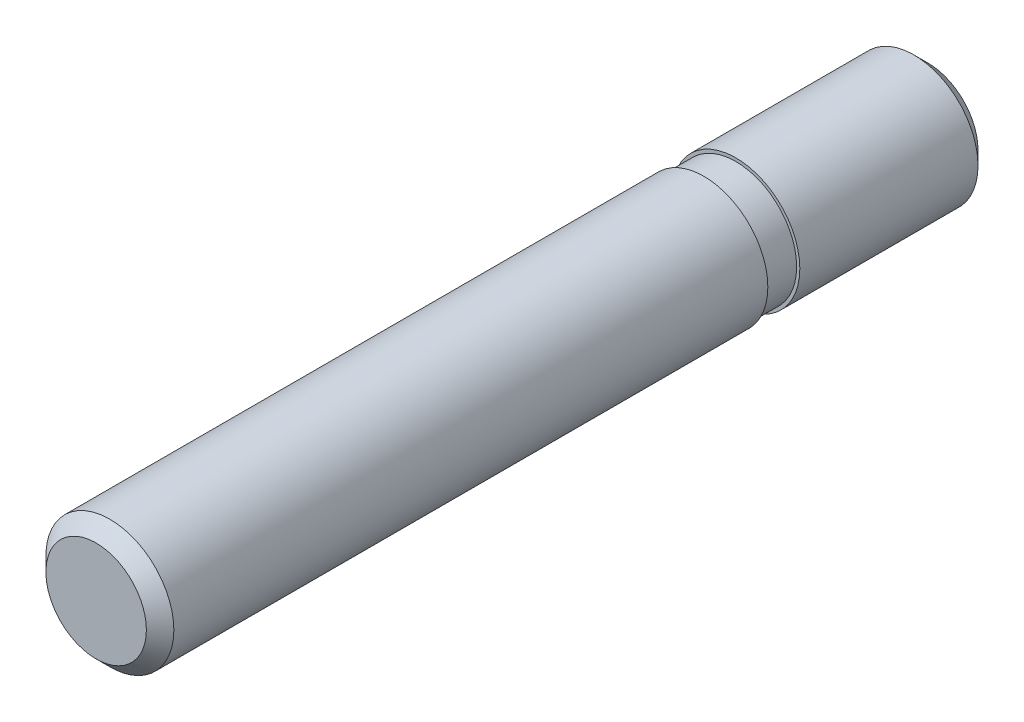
ISO-10303-21;
HEADER;
FILE_DESCRIPTION(('STEP AP214'),'2;1');
FILE_NAME('part.step','',(''),(''),'','','');
FILE_SCHEMA(('AUTOMOTIVE_DESIGN { 1 0 10303 214 1 1 1 1 }'));
ENDSEC;
DATA;
#1=APPLICATION_CONTEXT('core data for automotive mechanical design processes');
#2=APPLICATION_PROTOCOL_DEFINITION('international standard','automotive_design',2000,#1);
#3=PRODUCT_CONTEXT('',#1,'mechanical');
#4=PRODUCT('Part','Part','',(#3));
#5=PRODUCT_RELATED_PRODUCT_CATEGORY('part','',(#4));
#6=PRODUCT_DEFINITION_FORMATION('','',#4);
#7=PRODUCT_DEFINITION_CONTEXT('part definition',#1,'design');
#8=PRODUCT_DEFINITION('design','',#6,#7);
#9=PRODUCT_DEFINITION_SHAPE('','',#8);
#10=(LENGTH_UNIT() NAMED_UNIT(*) SI_UNIT(.MILLI.,.METRE.));
#11=(NAMED_UNIT(*) PLANE_ANGLE_UNIT() SI_UNIT($,.RADIAN.));
#12=(NAMED_UNIT(*) SI_UNIT($,.STERADIAN.) SOLID_ANGLE_UNIT());
#13=UNCERTAINTY_MEASURE_WITH_UNIT(LENGTH_MEASURE(1.E-05),#10,'distance_accuracy_value','');
#14=(GEOMETRIC_REPRESENTATION_CONTEXT(3) GLOBAL_UNCERTAINTY_ASSIGNED_CONTEXT((#13)) GLOBAL_UNIT_ASSIGNED_CONTEXT((#10,
#11,#12)) REPRESENTATION_CONTEXT('',''));
#15=CARTESIAN_POINT('',(0.,0.,0.));
#16=DIRECTION('',(0.,0.,1.));
#17=DIRECTION('',(1.,0.,0.));
#18=AXIS2_PLACEMENT_3D('',#15,#16,#17);
#19=CARTESIAN_POINT('',(0.,0.,1.));
#20=DIRECTION('',(0.,0.,1.));
#21=DIRECTION('',(1.,0.,0.));
#22=AXIS2_PLACEMENT_3D('',#19,#20,#21);
#23=PLANE('',#22);
#24=CARTESIAN_POINT('',(0.,0.,1.));
#25=DIRECTION('',(0.,0.,1.));
#26=DIRECTION('',(1.,0.,0.));
#27=AXIS2_PLACEMENT_3D('',#24,#25,#26);
#28=CIRCLE('',#27,2.);
#29=CARTESIAN_POINT('',(2.,0.,1.));
#30=VERTEX_POINT('',#29);
#31=EDGE_CURVE('E27',#30,#30,#28,.T.);
#32=ORIENTED_EDGE('',*,*,#31,.F.);
#33=EDGE_LOOP('',(#32));
#34=FACE_BOUND('',#33,.T.);
#35=CARTESIAN_POINT('',(0.,0.,1.));
#36=DIRECTION('',(0.,0.,1.));
#37=DIRECTION('',(1.,0.,0.));
#38=AXIS2_PLACEMENT_3D('',#35,#36,#37);
#39=CIRCLE('',#38,1.9);
#40=CARTESIAN_POINT('',(1.9,0.,1.));
#41=VERTEX_POINT('',#40);
#42=EDGE_CURVE('E8',#41,#41,#39,.F.);
#43=ORIENTED_EDGE('',*,*,#42,.F.);
#44=EDGE_LOOP('',(#43));
#45=FACE_BOUND('',#44,.T.);
#46=ADVANCED_FACE('F12',(#34,#45),#23,.F.);
#47=CARTESIAN_POINT('',(0.,0.,7.5));
#48=DIRECTION('',(0.,0.,1.));
#49=DIRECTION('',(1.,0.,0.));
#50=AXIS2_PLACEMENT_3D('',#47,#48,#49);
#51=CYLINDRICAL_SURFACE('',#50,2.);
#52=CARTESIAN_POINT('',(0.,0.,19.5705));
#53=DIRECTION('',(0.,0.,1.));
#54=DIRECTION('',(1.,0.,0.));
#55=AXIS2_PLACEMENT_3D('',#52,#53,#54);
#56=CIRCLE('',#55,2.);
#57=CARTESIAN_POINT('',(2.,0.,19.5705));
#58=VERTEX_POINT('',#57);
#59=EDGE_CURVE('E19',#58,#58,#56,.F.);
#60=ORIENTED_EDGE('',*,*,#59,.T.);
#61=EDGE_LOOP('',(#60));
#62=FACE_BOUND('',#61,.T.);
#63=ORIENTED_EDGE('',*,*,#31,.T.);
#64=EDGE_LOOP('',(#63));
#65=FACE_BOUND('',#64,.T.);
#66=ADVANCED_FACE('F14',(#62,#65),#51,.T.);
#67=CARTESIAN_POINT('',(0.,0.,20.));
#68=DIRECTION('',(0.,0.,1.));
#69=DIRECTION('',(1.,0.,0.));
#70=AXIS2_PLACEMENT_3D('',#67,#68,#69);
#71=PLANE('',#70);
#72=CARTESIAN_POINT('',(0.,0.,20.));
#73=DIRECTION('',(0.,0.,1.));
#74=DIRECTION('',(1.,0.,0.));
#75=AXIS2_PLACEMENT_3D('',#72,#73,#74);
#76=CIRCLE('',#75,1.5705);
#77=CARTESIAN_POINT('',(1.5705,0.,20.));
#78=VERTEX_POINT('',#77);
#79=EDGE_CURVE('E23',#78,#78,#76,.T.);
#80=ORIENTED_EDGE('',*,*,#79,.T.);
#81=EDGE_LOOP('',(#80));
#82=FACE_BOUND('',#81,.T.);
#83=ADVANCED_FACE('F64',(#82),#71,.T.);
#84=CARTESIAN_POINT('',(0.,0.,20.));
#85=DIRECTION('',(0.,0.,-1.));
#86=DIRECTION('',(-1.,0.,0.));
#87=AXIS2_PLACEMENT_3D('',#84,#85,#86);
#88=CONICAL_SURFACE('',#87,1.5705,0.785398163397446);
#89=ORIENTED_EDGE('',*,*,#59,.F.);
#90=EDGE_LOOP('',(#89));
#91=FACE_BOUND('',#90,.T.);
#92=ORIENTED_EDGE('',*,*,#79,.F.);
#93=EDGE_LOOP('',(#92));
#94=FACE_BOUND('',#93,.T.);
#95=ADVANCED_FACE('F71',(#91,#94),#88,.T.);
#96=CARTESIAN_POINT('',(0.,0.,4.66928550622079));
#97=DIRECTION('',(0.,0.,1.));
#98=DIRECTION('',(1.,0.,0.));
#99=AXIS2_PLACEMENT_3D('',#96,#97,#98);
#100=CYLINDRICAL_SURFACE('',#99,1.9);
#101=ORIENTED_EDGE('',*,*,#42,.T.);
#102=EDGE_LOOP('',(#101));
#103=FACE_BOUND('',#102,.T.);
#104=CARTESIAN_POINT('',(0.,0.,0.));
#105=DIRECTION('',(0.,0.,1.));
#106=DIRECTION('',(1.,0.,0.));
#107=AXIS2_PLACEMENT_3D('',#104,#105,#106);
#108=CIRCLE('',#107,1.9);
#109=CARTESIAN_POINT('',(1.9,0.,0.));
#110=VERTEX_POINT('',#109);
#111=EDGE_CURVE('E34',#110,#110,#108,.T.);
#112=ORIENTED_EDGE('',*,*,#111,.T.);
#113=EDGE_LOOP('',(#112));
#114=FACE_BOUND('',#113,.T.);
#115=ADVANCED_FACE('F45',(#103,#114),#100,.T.);
#116=CARTESIAN_POINT('',(0.,0.78525,-6.));
#117=DIRECTION('',(0.,0.,-1.));
#118=DIRECTION('',(-1.,0.,0.));
#119=AXIS2_PLACEMENT_3D('',#116,#117,#118);
#120=PLANE('',#119);
#121=CARTESIAN_POINT('',(0.,0.,-5.99999999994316));
#122=DIRECTION('',(0.,0.,1.));
#123=DIRECTION('',(1.,0.,0.));
#124=AXIS2_PLACEMENT_3D('',#121,#122,#123);
#125=CIRCLE('',#124,1.57050000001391);
#126=CARTESIAN_POINT('',(1.57050000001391,0.,-5.99999999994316));
#127=VERTEX_POINT('',#126);
#128=EDGE_CURVE('E30',#127,#127,#125,.T.);
#129=ORIENTED_EDGE('',*,*,#128,.F.);
#130=EDGE_LOOP('',(#129));
#131=FACE_BOUND('',#130,.T.);
#132=ADVANCED_FACE('F81',(#131),#120,.T.);
#133=CARTESIAN_POINT('',(0.,0.,-5.5705000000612));
#134=DIRECTION('',(0.,0.,1.));
#135=DIRECTION('',(1.,0.,0.));
#136=AXIS2_PLACEMENT_3D('',#133,#134,#135);
#137=CONICAL_SURFACE('',#136,1.9999999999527,0.785398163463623);
#138=CARTESIAN_POINT('',(0.,0.,-5.5705));
#139=DIRECTION('',(0.,0.,1.));
#140=DIRECTION('',(1.,0.,0.));
#141=AXIS2_PLACEMENT_3D('',#138,#139,#140);
#142=CIRCLE('',#141,2.);
#143=CARTESIAN_POINT('',(2.,0.,-5.5705));
#144=VERTEX_POINT('',#143);
#145=EDGE_CURVE('E33',#144,#144,#142,.T.);
#146=ORIENTED_EDGE('',*,*,#145,.F.);
#147=EDGE_LOOP('',(#146));
#148=FACE_BOUND('',#147,.T.);
#149=ORIENTED_EDGE('',*,*,#128,.T.);
#150=EDGE_LOOP('',(#149));
#151=FACE_BOUND('',#150,.T.);
#152=ADVANCED_FACE('F56',(#148,#151),#137,.T.);
#153=CARTESIAN_POINT('',(0.,0.,7.5));
#154=DIRECTION('',(0.,0.,1.));
#155=DIRECTION('',(1.,0.,0.));
#156=AXIS2_PLACEMENT_3D('',#153,#154,#155);
#157=CYLINDRICAL_SURFACE('',#156,2.);
#158=CARTESIAN_POINT('',(0.,0.,0.));
#159=DIRECTION('',(0.,0.,1.));
#160=DIRECTION('',(1.,0.,0.));
#161=AXIS2_PLACEMENT_3D('',#158,#159,#160);
#162=CIRCLE('',#161,2.);
#163=CARTESIAN_POINT('',(2.,0.,0.));
#164=VERTEX_POINT('',#163);
#165=EDGE_CURVE('E35',#164,#164,#162,.T.);
#166=ORIENTED_EDGE('',*,*,#165,.F.);
#167=EDGE_LOOP('',(#166));
#168=FACE_BOUND('',#167,.T.);
#169=ORIENTED_EDGE('',*,*,#145,.T.);
#170=EDGE_LOOP('',(#169));
#171=FACE_BOUND('',#170,.T.);
#172=ADVANCED_FACE('F49',(#168,#171),#157,.T.);
#173=CARTESIAN_POINT('',(0.,0.,0.));
#174=DIRECTION('',(0.,0.,1.));
#175=DIRECTION('',(1.,0.,0.));
#176=AXIS2_PLACEMENT_3D('',#173,#174,#175);
#177=PLANE('',#176);
#178=ORIENTED_EDGE('',*,*,#165,.T.);
#179=EDGE_LOOP('',(#178));
#180=FACE_BOUND('',#179,.T.);
#181=ORIENTED_EDGE('',*,*,#111,.F.);
#182=EDGE_LOOP('',(#181));
#183=FACE_BOUND('',#182,.T.);
#184=ADVANCED_FACE('F47',(#180,#183),#177,.T.);
#185=CLOSED_SHELL('',(#46,#66,#83,#95,#115,#132,#152,#172,#184));
#186=MANIFOLD_SOLID_BREP('B1',#185);
#187=ADVANCED_BREP_SHAPE_REPRESENTATION('',(#18,#186),#14);
#188=SHAPE_DEFINITION_REPRESENTATION(#9,#187);
ENDSEC;
END-ISO-10303-21;
